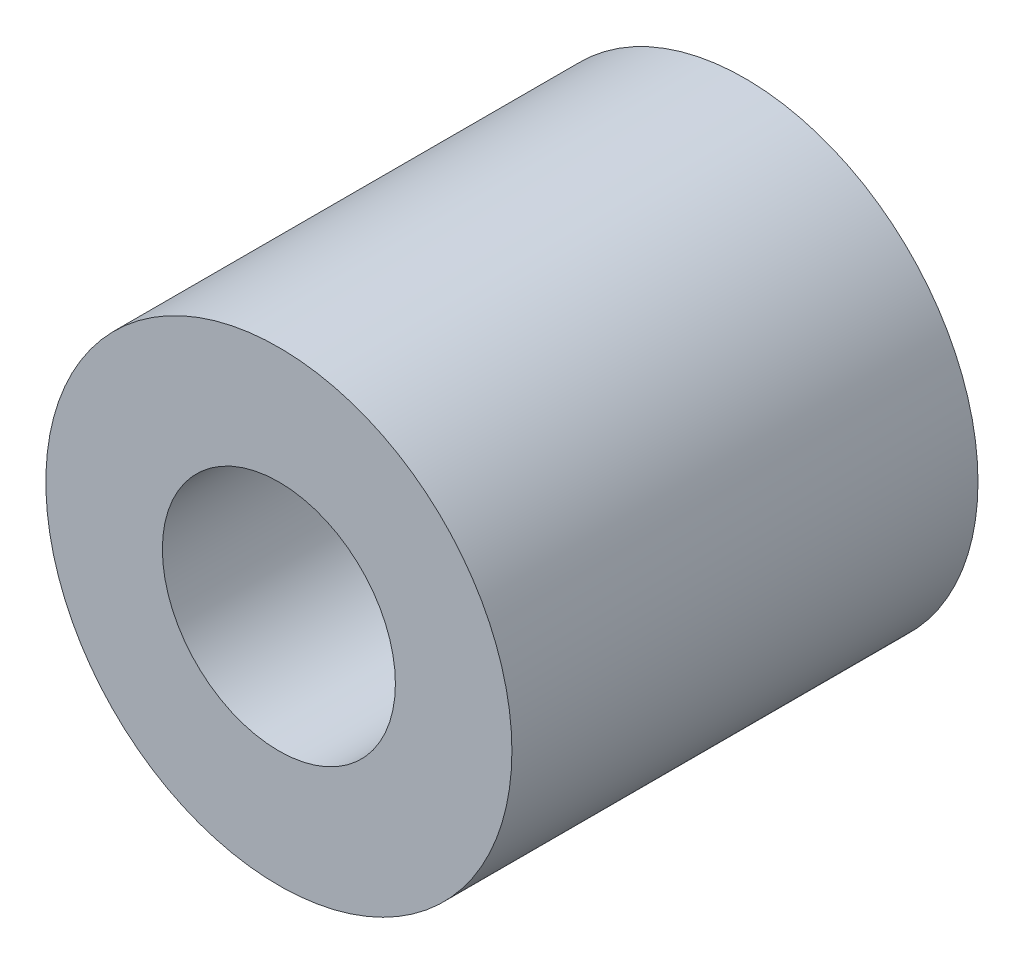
ISO-10303-21;
HEADER;
FILE_DESCRIPTION(('STEP AP214'),'2;1');
FILE_NAME('part.step','',(''),(''),'','','');
FILE_SCHEMA(('AUTOMOTIVE_DESIGN { 1 0 10303 214 1 1 1 1 }'));
ENDSEC;
DATA;
#1=APPLICATION_CONTEXT('core data for automotive mechanical design processes');
#2=APPLICATION_PROTOCOL_DEFINITION('international standard','automotive_design',2000,#1);
#3=PRODUCT_CONTEXT('',#1,'mechanical');
#4=PRODUCT('Part','Part','',(#3));
#5=PRODUCT_RELATED_PRODUCT_CATEGORY('part','',(#4));
#6=PRODUCT_DEFINITION_FORMATION('','',#4);
#7=PRODUCT_DEFINITION_CONTEXT('part definition',#1,'design');
#8=PRODUCT_DEFINITION('design','',#6,#7);
#9=PRODUCT_DEFINITION_SHAPE('','',#8);
#10=(LENGTH_UNIT() NAMED_UNIT(*) SI_UNIT(.MILLI.,.METRE.));
#11=(NAMED_UNIT(*) PLANE_ANGLE_UNIT() SI_UNIT($,.RADIAN.));
#12=(NAMED_UNIT(*) SI_UNIT($,.STERADIAN.) SOLID_ANGLE_UNIT());
#13=UNCERTAINTY_MEASURE_WITH_UNIT(LENGTH_MEASURE(1.E-05),#10,'distance_accuracy_value','');
#14=(GEOMETRIC_REPRESENTATION_CONTEXT(3) GLOBAL_UNCERTAINTY_ASSIGNED_CONTEXT((#13)) GLOBAL_UNIT_ASSIGNED_CONTEXT((#10,
#11,#12)) REPRESENTATION_CONTEXT('',''));
#15=CARTESIAN_POINT('',(0.,0.,0.));
#16=DIRECTION('',(0.,0.,1.));
#17=DIRECTION('',(1.,0.,0.));
#18=AXIS2_PLACEMENT_3D('',#15,#16,#17);
#19=CARTESIAN_POINT('',(10.,0.,12.));
#20=DIRECTION('',(0.,0.,-1.));
#21=DIRECTION('',(-1.,0.,0.));
#22=AXIS2_PLACEMENT_3D('',#19,#20,#21);
#23=PLANE('',#22);
#24=CARTESIAN_POINT('',(0.,0.,12.));
#25=DIRECTION('',(0.,0.,1.));
#26=DIRECTION('',(1.,0.,0.));
#27=AXIS2_PLACEMENT_3D('',#24,#25,#26);
#28=CIRCLE('',#27,7.);
#29=CARTESIAN_POINT('',(7.,0.,12.));
#30=VERTEX_POINT('',#29);
#31=EDGE_CURVE('E8',#30,#30,#28,.T.);
#32=ORIENTED_EDGE('',*,*,#31,.F.);
#33=EDGE_LOOP('',(#32));
#34=FACE_BOUND('',#33,.T.);
#35=CARTESIAN_POINT('',(0.,0.,12.));
#36=DIRECTION('',(0.,0.,1.));
#37=DIRECTION('',(1.,0.,0.));
#38=AXIS2_PLACEMENT_3D('',#35,#36,#37);
#39=CIRCLE('',#38,10.);
#40=CARTESIAN_POINT('',(10.,0.,12.));
#41=VERTEX_POINT('',#40);
#42=EDGE_CURVE('E34',#41,#41,#39,.T.);
#43=ORIENTED_EDGE('',*,*,#42,.T.);
#44=EDGE_LOOP('',(#43));
#45=FACE_BOUND('',#44,.T.);
#46=ADVANCED_FACE('F12',(#34,#45),#23,.F.);
#47=CARTESIAN_POINT('',(0.,0.,40.));
#48=DIRECTION('',(0.,0.,1.));
#49=DIRECTION('',(1.,0.,0.));
#50=AXIS2_PLACEMENT_3D('',#47,#48,#49);
#51=CYLINDRICAL_SURFACE('',#50,7.);
#52=CARTESIAN_POINT('',(0.,0.,0.));
#53=DIRECTION('',(0.,0.,1.));
#54=DIRECTION('',(1.,0.,0.));
#55=AXIS2_PLACEMENT_3D('',#52,#53,#54);
#56=CIRCLE('',#55,7.);
#57=CARTESIAN_POINT('',(7.,0.,0.));
#58=VERTEX_POINT('',#57);
#59=EDGE_CURVE('E18',#58,#58,#56,.T.);
#60=ORIENTED_EDGE('',*,*,#59,.F.);
#61=EDGE_LOOP('',(#60));
#62=FACE_BOUND('',#61,.T.);
#63=ORIENTED_EDGE('',*,*,#31,.T.);
#64=EDGE_LOOP('',(#63));
#65=FACE_BOUND('',#64,.T.);
#66=ADVANCED_FACE('F59',(#62,#65),#51,.F.);
#67=CARTESIAN_POINT('',(7.,0.,0.));
#68=DIRECTION('',(0.,0.,1.));
#69=DIRECTION('',(1.,0.,0.));
#70=AXIS2_PLACEMENT_3D('',#67,#68,#69);
#71=PLANE('',#70);
#72=CARTESIAN_POINT('',(0.,0.,0.));
#73=DIRECTION('',(0.,0.,1.));
#74=DIRECTION('',(1.,0.,0.));
#75=AXIS2_PLACEMENT_3D('',#72,#73,#74);
#76=CIRCLE('',#75,20.);
#77=CARTESIAN_POINT('',(20.,0.,0.));
#78=VERTEX_POINT('',#77);
#79=EDGE_CURVE('E22',#78,#78,#76,.T.);
#80=ORIENTED_EDGE('',*,*,#79,.F.);
#81=EDGE_LOOP('',(#80));
#82=FACE_BOUND('',#81,.T.);
#83=ORIENTED_EDGE('',*,*,#59,.T.);
#84=EDGE_LOOP('',(#83));
#85=FACE_BOUND('',#84,.T.);
#86=ADVANCED_FACE('F54',(#82,#85),#71,.F.);
#87=CARTESIAN_POINT('',(0.,0.,40.));
#88=DIRECTION('',(0.,0.,1.));
#89=DIRECTION('',(1.,0.,0.));
#90=AXIS2_PLACEMENT_3D('',#87,#88,#89);
#91=CYLINDRICAL_SURFACE('',#90,20.);
#92=CARTESIAN_POINT('',(0.,0.,40.));
#93=DIRECTION('',(0.,0.,1.));
#94=DIRECTION('',(1.,0.,0.));
#95=AXIS2_PLACEMENT_3D('',#92,#93,#94);
#96=CIRCLE('',#95,20.);
#97=CARTESIAN_POINT('',(20.,0.,40.));
#98=VERTEX_POINT('',#97);
#99=EDGE_CURVE('E26',#98,#98,#96,.T.);
#100=ORIENTED_EDGE('',*,*,#99,.F.);
#101=EDGE_LOOP('',(#100));
#102=FACE_BOUND('',#101,.T.);
#103=ORIENTED_EDGE('',*,*,#79,.T.);
#104=EDGE_LOOP('',(#103));
#105=FACE_BOUND('',#104,.T.);
#106=ADVANCED_FACE('F48',(#102,#105),#91,.T.);
#107=CARTESIAN_POINT('',(20.,0.,40.));
#108=DIRECTION('',(0.,0.,-1.));
#109=DIRECTION('',(-1.,0.,0.));
#110=AXIS2_PLACEMENT_3D('',#107,#108,#109);
#111=PLANE('',#110);
#112=CARTESIAN_POINT('',(0.,0.,40.));
#113=DIRECTION('',(0.,0.,1.));
#114=DIRECTION('',(1.,0.,0.));
#115=AXIS2_PLACEMENT_3D('',#112,#113,#114);
#116=CIRCLE('',#115,10.);
#117=CARTESIAN_POINT('',(10.,0.,40.));
#118=VERTEX_POINT('',#117);
#119=EDGE_CURVE('E31',#118,#118,#116,.T.);
#120=ORIENTED_EDGE('',*,*,#119,.F.);
#121=EDGE_LOOP('',(#120));
#122=FACE_BOUND('',#121,.T.);
#123=ORIENTED_EDGE('',*,*,#99,.T.);
#124=EDGE_LOOP('',(#123));
#125=FACE_BOUND('',#124,.T.);
#126=ADVANCED_FACE('F42',(#122,#125),#111,.F.);
#127=CARTESIAN_POINT('',(0.,0.,40.));
#128=DIRECTION('',(0.,0.,1.));
#129=DIRECTION('',(1.,0.,0.));
#130=AXIS2_PLACEMENT_3D('',#127,#128,#129);
#131=CYLINDRICAL_SURFACE('',#130,10.);
#132=ORIENTED_EDGE('',*,*,#42,.F.);
#133=EDGE_LOOP('',(#132));
#134=FACE_BOUND('',#133,.T.);
#135=ORIENTED_EDGE('',*,*,#119,.T.);
#136=EDGE_LOOP('',(#135));
#137=FACE_BOUND('',#136,.T.);
#138=ADVANCED_FACE('F39',(#134,#137),#131,.F.);
#139=CLOSED_SHELL('',(#46,#66,#86,#106,#126,#138));
#140=MANIFOLD_SOLID_BREP('B1',#139);
#141=ADVANCED_BREP_SHAPE_REPRESENTATION('',(#18,#140),#14);
#142=SHAPE_DEFINITION_REPRESENTATION(#9,#141);
ENDSEC;
END-ISO-10303-21;
